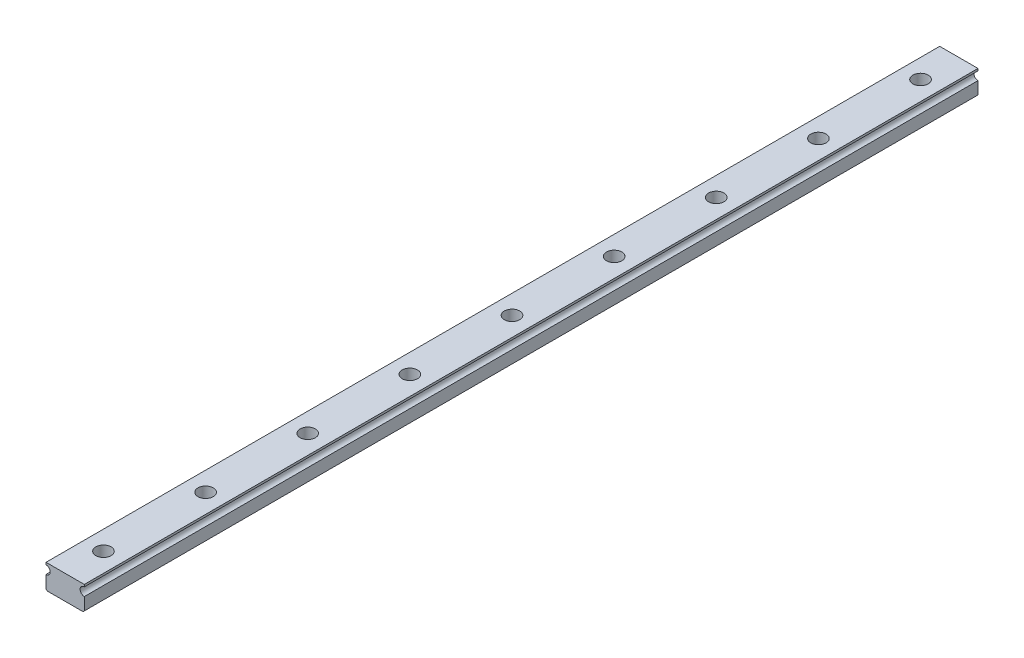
from build123d import *

# Parameters (mm, degrees)
EXTRUDE_1_DEPTH = 350


with BuildPart() as part:
    # Sketch 1 → Extrude 1 (new body)
    with BuildSketch(Plane.XY):
        with BuildLine():
            Line((-7.5, 9.5), (-7.5, 8.66))
            ThreePointArc((-7.5, 8.66), (-5.86, 7.02), (-7.5, 5.38))
            Line((-7.5, 5.38), (-7.5, 0.494974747))
            Line((-7.5, 0.494974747), (-7.005025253, 0))
            Line((-7.005025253, 0), (7.005025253, 0))
            Line((7.005025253, 0), (7.5, 0.494974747))
            Line((7.5, 0.494974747), (7.5, 5.38))
            ThreePointArc((7.5, 5.38), (5.86, 7.02), (7.5, 8.66))
            Line((7.5, 8.66), (7.5, 9.5))
            Line((7.5, 9.5), (-7.5, 9.5))
        make_face()
    extrude(amount=EXTRUDE_1_DEPTH)

    # Sketch 2 → Cut-Revolve 1 (revolve, cut)
    with BuildSketch(Plane(origin=(0, 0, 0), x_dir=(0, 0, -1), z_dir=(1, 0, 0)), mode=Mode.PRIVATE) as cut_revolve_1_sk:
        Polygon((-15, 9.5), (-12, 9.5), (-12, 5), (-13.25, 5), (-13.25, 0), (-15, 0), align=None)
    revolve(cut_revolve_1_sk.sketch.rotate(Axis((0, 0, 15), (0, 1, 0)), 180), axis=Axis((0, 0, 15), (0, 1, 0)), mode=Mode.SUBTRACT)

    # Sketch 3 → Cut-Revolve 2 (revolve, cut)
    with BuildSketch(Plane(origin=(0, 0, 0), x_dir=(0, 0, -1), z_dir=(1, 0, 0)), mode=Mode.PRIVATE) as cut_revolve_2_sk:
        Polygon((-335, 9.5), (-332, 9.5), (-332, 5), (-333.25, 5), (-333.25, 0), (-335, 0), align=None)
    revolve(cut_revolve_2_sk.sketch.rotate(Axis((0, 0, 335), (0, 1, 0)), 180), axis=Axis((0, 0, 335), (0, 1, 0)), mode=Mode.SUBTRACT)

    # Sketch 4 → Cut-Revolve 3 (revolve, cut)
    with BuildSketch(Plane(origin=(0, 0, 0), x_dir=(0, 0, -1), z_dir=(1, 0, 0)), mode=Mode.PRIVATE) as cut_revolve_3_sk:
        Polygon((-295, 9.5), (-292, 9.5), (-292, 5), (-293.25, 5), (-293.25, 0), (-295, 0), align=None)
    revolve(cut_revolve_3_sk.sketch.rotate(Axis((0, 0, 295), (0, 1, 0)), 180), axis=Axis((0, 0, 295), (0, 1, 0)), mode=Mode.SUBTRACT)

    # Sketch 5 → Cut-Revolve 4 (revolve, cut)
    with BuildSketch(Plane(origin=(0, 0, 0), x_dir=(0, 0, -1), z_dir=(1, 0, 0)), mode=Mode.PRIVATE) as cut_revolve_4_sk:
        Polygon((-255, 9.5), (-252, 9.5), (-252, 5), (-253.25, 5), (-253.25, 0), (-255, 0), align=None)
    revolve(cut_revolve_4_sk.sketch.rotate(Axis((0, 0, 255), (0, 1, 0)), 180), axis=Axis((0, 0, 255), (0, 1, 0)), mode=Mode.SUBTRACT)

    # Sketch 6 → Cut-Revolve 5 (revolve, cut)
    with BuildSketch(Plane(origin=(0, 0, 0), x_dir=(0, 0, -1), z_dir=(1, 0, 0)), mode=Mode.PRIVATE) as cut_revolve_5_sk:
        Polygon((-215, 9.5), (-212, 9.5), (-212, 5), (-213.25, 5), (-213.25, 0), (-215, 0), align=None)
    revolve(cut_revolve_5_sk.sketch.rotate(Axis((0, 0, 215), (0, 1, 0)), 180), axis=Axis((0, 0, 215), (0, 1, 0)), mode=Mode.SUBTRACT)

    # Sketch 7 → Cut-Revolve 6 (revolve, cut)
    with BuildSketch(Plane(origin=(0, 0, 0), x_dir=(0, 0, -1), z_dir=(1, 0, 0)), mode=Mode.PRIVATE) as cut_revolve_6_sk:
        Polygon((-175, 9.5), (-172, 9.5), (-172, 5), (-173.25, 5), (-173.25, 0), (-175, 0), align=None)
    revolve(cut_revolve_6_sk.sketch.rotate(Axis((0, 0, 175), (0, 1, 0)), 180), axis=Axis((0, 0, 175), (0, 1, 0)), mode=Mode.SUBTRACT)

    # Sketch 8 → Cut-Revolve 7 (revolve, cut)
    with BuildSketch(Plane(origin=(0, 0, 0), x_dir=(0, 0, -1), z_dir=(1, 0, 0)), mode=Mode.PRIVATE) as cut_revolve_7_sk:
        Polygon((-135, 9.5), (-132, 9.5), (-132, 5), (-133.25, 5), (-133.25, 0), (-135, 0), align=None)
    revolve(cut_revolve_7_sk.sketch.rotate(Axis((0, 0, 135), (0, 1, 0)), 180), axis=Axis((0, 0, 135), (0, 1, 0)), mode=Mode.SUBTRACT)

    # Sketch 9 → Cut-Revolve 8 (revolve, cut)
    with BuildSketch(Plane(origin=(0, 0, 0), x_dir=(0, 0, -1), z_dir=(1, 0, 0)), mode=Mode.PRIVATE) as cut_revolve_8_sk:
        Polygon((-95, 9.5), (-92, 9.5), (-92, 5), (-93.25, 5), (-93.25, 0), (-95, 0), align=None)
    revolve(cut_revolve_8_sk.sketch.rotate(Axis((0, 0, 95), (0, 1, 0)), 180), axis=Axis((0, 0, 95), (0, 1, 0)), mode=Mode.SUBTRACT)

    # Sketch 10 → Cut-Revolve 9 (revolve, cut)
    with BuildSketch(Plane(origin=(0, 0, 0), x_dir=(0, 0, -1), z_dir=(1, 0, 0)), mode=Mode.PRIVATE) as cut_revolve_9_sk:
        Polygon((-55, 9.5), (-52, 9.5), (-52, 5), (-53.25, 5), (-53.25, 0), (-55, 0), align=None)
    revolve(cut_revolve_9_sk.sketch.rotate(Axis((0, 0, 55), (0, 1, 0)), 180), axis=Axis((0, 0, 55), (0, 1, 0)), mode=Mode.SUBTRACT)


solid = part.part
